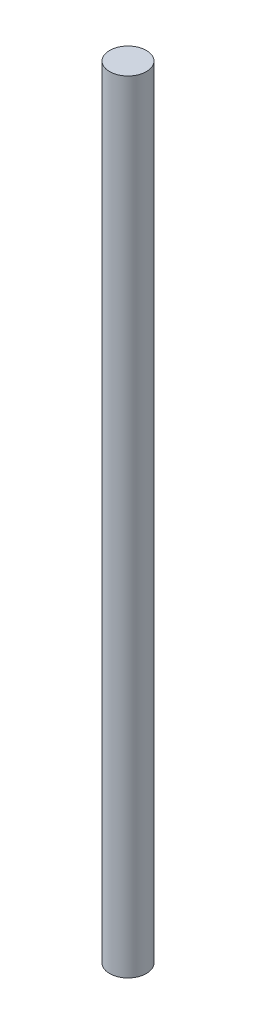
ISO-10303-21;
HEADER;
FILE_DESCRIPTION(('STEP AP214'),'2;1');
FILE_NAME('part.step','',(''),(''),'','','');
FILE_SCHEMA(('AUTOMOTIVE_DESIGN { 1 0 10303 214 1 1 1 1 }'));
ENDSEC;
DATA;
#1=APPLICATION_CONTEXT('core data for automotive mechanical design processes');
#2=APPLICATION_PROTOCOL_DEFINITION('international standard','automotive_design',2000,#1);
#3=PRODUCT_CONTEXT('',#1,'mechanical');
#4=PRODUCT('Part','Part','',(#3));
#5=PRODUCT_RELATED_PRODUCT_CATEGORY('part','',(#4));
#6=PRODUCT_DEFINITION_FORMATION('','',#4);
#7=PRODUCT_DEFINITION_CONTEXT('part definition',#1,'design');
#8=PRODUCT_DEFINITION('design','',#6,#7);
#9=PRODUCT_DEFINITION_SHAPE('','',#8);
#10=(LENGTH_UNIT() NAMED_UNIT(*) SI_UNIT(.MILLI.,.METRE.));
#11=(NAMED_UNIT(*) PLANE_ANGLE_UNIT() SI_UNIT($,.RADIAN.));
#12=(NAMED_UNIT(*) SI_UNIT($,.STERADIAN.) SOLID_ANGLE_UNIT());
#13=UNCERTAINTY_MEASURE_WITH_UNIT(LENGTH_MEASURE(1.E-05),#10,'distance_accuracy_value','');
#14=(GEOMETRIC_REPRESENTATION_CONTEXT(3) GLOBAL_UNCERTAINTY_ASSIGNED_CONTEXT((#13)) GLOBAL_UNIT_ASSIGNED_CONTEXT((#10,
#11,#12)) REPRESENTATION_CONTEXT('',''));
#15=CARTESIAN_POINT('',(0.,0.,0.));
#16=DIRECTION('',(0.,0.,1.));
#17=DIRECTION('',(1.,0.,0.));
#18=AXIS2_PLACEMENT_3D('',#15,#16,#17);
#19=CARTESIAN_POINT('',(0.,85.,0.));
#20=DIRECTION('',(0.,-1.,0.));
#21=DIRECTION('',(0.,0.,-1.));
#22=AXIS2_PLACEMENT_3D('',#19,#20,#21);
#23=CYLINDRICAL_SURFACE('',#22,4.);
#24=CARTESIAN_POINT('',(0.,85.,0.));
#25=DIRECTION('',(0.,1.,0.));
#26=DIRECTION('',(0.,0.,1.));
#27=AXIS2_PLACEMENT_3D('',#24,#25,#26);
#28=CIRCLE('',#27,4.);
#29=CARTESIAN_POINT('',(0.,85.,4.));
#30=VERTEX_POINT('',#29);
#31=EDGE_CURVE('E10',#30,#30,#28,.T.);
#32=ORIENTED_EDGE('',*,*,#31,.F.);
#33=EDGE_LOOP('',(#32));
#34=FACE_BOUND('',#33,.T.);
#35=CARTESIAN_POINT('',(0.,-85.,0.));
#36=DIRECTION('',(0.,1.,0.));
#37=DIRECTION('',(0.,0.,1.));
#38=AXIS2_PLACEMENT_3D('',#35,#36,#37);
#39=CIRCLE('',#38,4.);
#40=CARTESIAN_POINT('',(0.,-85.,4.));
#41=VERTEX_POINT('',#40);
#42=EDGE_CURVE('E40',#41,#41,#39,.T.);
#43=ORIENTED_EDGE('',*,*,#42,.T.);
#44=EDGE_LOOP('',(#43));
#45=FACE_BOUND('',#44,.T.);
#46=ADVANCED_FACE('F37',(#34,#45),#23,.T.);
#47=CARTESIAN_POINT('',(0.,85.,0.));
#48=DIRECTION('',(0.,1.,0.));
#49=DIRECTION('',(0.,0.,1.));
#50=AXIS2_PLACEMENT_3D('',#47,#48,#49);
#51=PLANE('',#50);
#52=ORIENTED_EDGE('',*,*,#31,.T.);
#53=EDGE_LOOP('',(#52));
#54=FACE_BOUND('',#53,.T.);
#55=ADVANCED_FACE('F52',(#54),#51,.T.);
#56=CARTESIAN_POINT('',(0.,-85.,0.));
#57=DIRECTION('',(0.,1.,0.));
#58=DIRECTION('',(0.,0.,1.));
#59=AXIS2_PLACEMENT_3D('',#56,#57,#58);
#60=PLANE('',#59);
#61=ORIENTED_EDGE('',*,*,#42,.F.);
#62=EDGE_LOOP('',(#61));
#63=FACE_BOUND('',#62,.T.);
#64=ADVANCED_FACE('F50',(#63),#60,.F.);
#65=CLOSED_SHELL('',(#46,#55,#64));
#66=MANIFOLD_SOLID_BREP('B2',#65);
#67=ADVANCED_BREP_SHAPE_REPRESENTATION('',(#18,#66),#14);
#68=SHAPE_DEFINITION_REPRESENTATION(#9,#67);
ENDSEC;
END-ISO-10303-21;
